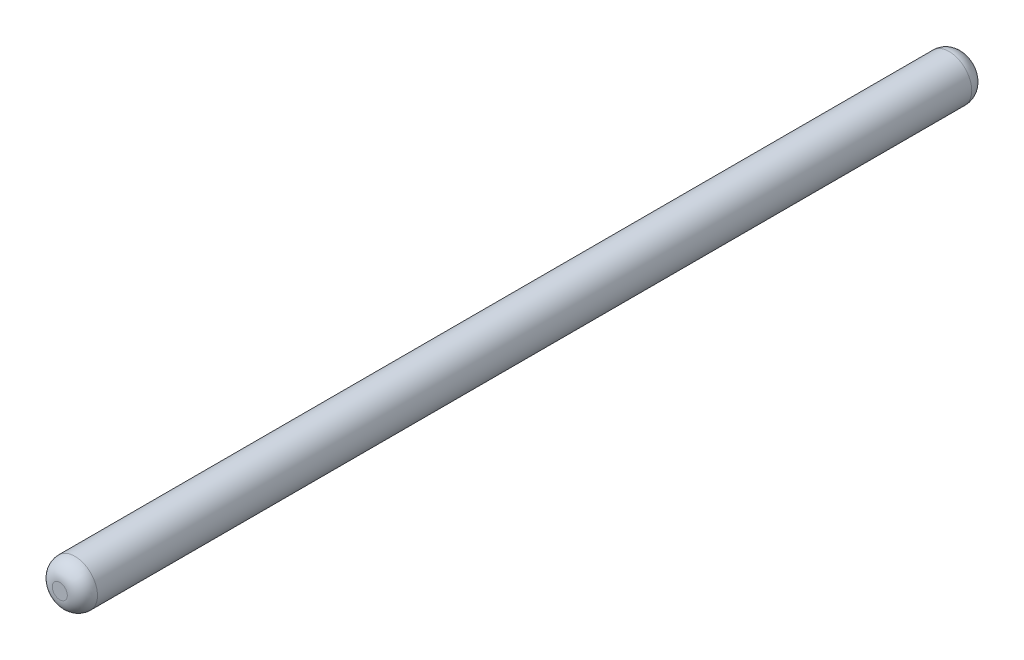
ISO-10303-21;
HEADER;
FILE_DESCRIPTION(('STEP AP214'),'2;1');
FILE_NAME('part.step','',(''),(''),'','','');
FILE_SCHEMA(('AUTOMOTIVE_DESIGN { 1 0 10303 214 1 1 1 1 }'));
ENDSEC;
DATA;
#1=APPLICATION_CONTEXT('core data for automotive mechanical design processes');
#2=APPLICATION_PROTOCOL_DEFINITION('international standard','automotive_design',2000,#1);
#3=PRODUCT_CONTEXT('',#1,'mechanical');
#4=PRODUCT('Part','Part','',(#3));
#5=PRODUCT_RELATED_PRODUCT_CATEGORY('part','',(#4));
#6=PRODUCT_DEFINITION_FORMATION('','',#4);
#7=PRODUCT_DEFINITION_CONTEXT('part definition',#1,'design');
#8=PRODUCT_DEFINITION('design','',#6,#7);
#9=PRODUCT_DEFINITION_SHAPE('','',#8);
#10=(LENGTH_UNIT() NAMED_UNIT(*) SI_UNIT(.MILLI.,.METRE.));
#11=(NAMED_UNIT(*) PLANE_ANGLE_UNIT() SI_UNIT($,.RADIAN.));
#12=(NAMED_UNIT(*) SI_UNIT($,.STERADIAN.) SOLID_ANGLE_UNIT());
#13=UNCERTAINTY_MEASURE_WITH_UNIT(LENGTH_MEASURE(1.E-05),#10,'distance_accuracy_value','');
#14=(GEOMETRIC_REPRESENTATION_CONTEXT(3) GLOBAL_UNCERTAINTY_ASSIGNED_CONTEXT((#13)) GLOBAL_UNIT_ASSIGNED_CONTEXT((#10,
#11,#12)) REPRESENTATION_CONTEXT('',''));
#15=CARTESIAN_POINT('',(0.,0.,0.));
#16=DIRECTION('',(0.,0.,1.));
#17=DIRECTION('',(1.,0.,0.));
#18=AXIS2_PLACEMENT_3D('',#15,#16,#17);
#19=CARTESIAN_POINT('',(0.,0.,30.));
#20=DIRECTION('',(0.,0.,-1.));
#21=DIRECTION('',(-1.,0.,0.));
#22=AXIS2_PLACEMENT_3D('',#19,#20,#21);
#23=CYLINDRICAL_SURFACE('',#22,1.5);
#24=CARTESIAN_POINT('',(0.,0.,-29.));
#25=DIRECTION('',(0.,0.,1.));
#26=DIRECTION('',(1.,0.,0.));
#27=AXIS2_PLACEMENT_3D('',#24,#25,#26);
#28=CIRCLE('',#27,1.5);
#29=CARTESIAN_POINT('',(1.5,0.,-29.));
#30=VERTEX_POINT('',#29);
#31=EDGE_CURVE('E41',#30,#30,#28,.T.);
#32=ORIENTED_EDGE('',*,*,#31,.T.);
#33=EDGE_LOOP('',(#32));
#34=FACE_BOUND('',#33,.T.);
#35=CARTESIAN_POINT('',(0.,0.,29.));
#36=DIRECTION('',(0.,0.,1.));
#37=DIRECTION('',(1.,0.,0.));
#38=AXIS2_PLACEMENT_3D('',#35,#36,#37);
#39=CIRCLE('',#38,1.5);
#40=CARTESIAN_POINT('',(1.5,0.,29.));
#41=VERTEX_POINT('',#40);
#42=EDGE_CURVE('E45',#41,#41,#39,.F.);
#43=ORIENTED_EDGE('',*,*,#42,.T.);
#44=EDGE_LOOP('',(#43));
#45=FACE_BOUND('',#44,.T.);
#46=ADVANCED_FACE('F30',(#34,#45),#23,.T.);
#47=CARTESIAN_POINT('',(0.,0.,30.));
#48=DIRECTION('',(0.,0.,1.));
#49=DIRECTION('',(1.,0.,0.));
#50=AXIS2_PLACEMENT_3D('',#47,#48,#49);
#51=PLANE('',#50);
#52=CARTESIAN_POINT('',(0.,0.,30.));
#53=DIRECTION('',(0.,0.,1.));
#54=DIRECTION('',(1.,0.,0.));
#55=AXIS2_PLACEMENT_3D('',#52,#53,#54);
#56=CIRCLE('',#55,0.5);
#57=CARTESIAN_POINT('',(0.5,0.,30.));
#58=VERTEX_POINT('',#57);
#59=EDGE_CURVE('E10',#58,#58,#56,.T.);
#60=ORIENTED_EDGE('',*,*,#59,.T.);
#61=EDGE_LOOP('',(#60));
#62=FACE_BOUND('',#61,.T.);
#63=ADVANCED_FACE('F61',(#62),#51,.T.);
#64=CARTESIAN_POINT('',(0.,0.,-30.));
#65=DIRECTION('',(0.,0.,1.));
#66=DIRECTION('',(1.,0.,0.));
#67=AXIS2_PLACEMENT_3D('',#64,#65,#66);
#68=PLANE('',#67);
#69=CARTESIAN_POINT('',(0.,0.,-30.));
#70=DIRECTION('',(0.,0.,1.));
#71=DIRECTION('',(1.,0.,0.));
#72=AXIS2_PLACEMENT_3D('',#69,#70,#71);
#73=CIRCLE('',#72,0.5);
#74=CARTESIAN_POINT('',(0.5,0.,-30.));
#75=VERTEX_POINT('',#74);
#76=EDGE_CURVE('E37',#75,#75,#73,.F.);
#77=ORIENTED_EDGE('',*,*,#76,.T.);
#78=EDGE_LOOP('',(#77));
#79=FACE_BOUND('',#78,.T.);
#80=ADVANCED_FACE('F58',(#79),#68,.F.);
#81=CARTESIAN_POINT('',(0.,0.,-29.));
#82=DIRECTION('',(0.,0.,1.));
#83=DIRECTION('',(1.,0.,0.));
#84=AXIS2_PLACEMENT_3D('',#81,#82,#83);
#85=DEGENERATE_TOROIDAL_SURFACE('',#84,0.5,1.,.T.);
#86=ORIENTED_EDGE('',*,*,#76,.F.);
#87=EDGE_LOOP('',(#86));
#88=FACE_BOUND('',#87,.T.);
#89=ORIENTED_EDGE('',*,*,#31,.F.);
#90=EDGE_LOOP('',(#89));
#91=FACE_BOUND('',#90,.T.);
#92=ADVANCED_FACE('F54',(#88,#91),#85,.T.);
#93=CARTESIAN_POINT('',(0.,0.,29.));
#94=DIRECTION('',(0.,0.,1.));
#95=DIRECTION('',(1.,0.,0.));
#96=AXIS2_PLACEMENT_3D('',#93,#94,#95);
#97=DEGENERATE_TOROIDAL_SURFACE('',#96,0.5,1.,.T.);
#98=ORIENTED_EDGE('',*,*,#42,.F.);
#99=EDGE_LOOP('',(#98));
#100=FACE_BOUND('',#99,.T.);
#101=ORIENTED_EDGE('',*,*,#59,.F.);
#102=EDGE_LOOP('',(#101));
#103=FACE_BOUND('',#102,.T.);
#104=ADVANCED_FACE('F32',(#100,#103),#97,.T.);
#105=CLOSED_SHELL('',(#46,#63,#80,#92,#104));
#106=MANIFOLD_SOLID_BREP('B2',#105);
#107=ADVANCED_BREP_SHAPE_REPRESENTATION('',(#18,#106),#14);
#108=SHAPE_DEFINITION_REPRESENTATION(#9,#107);
ENDSEC;
END-ISO-10303-21;
